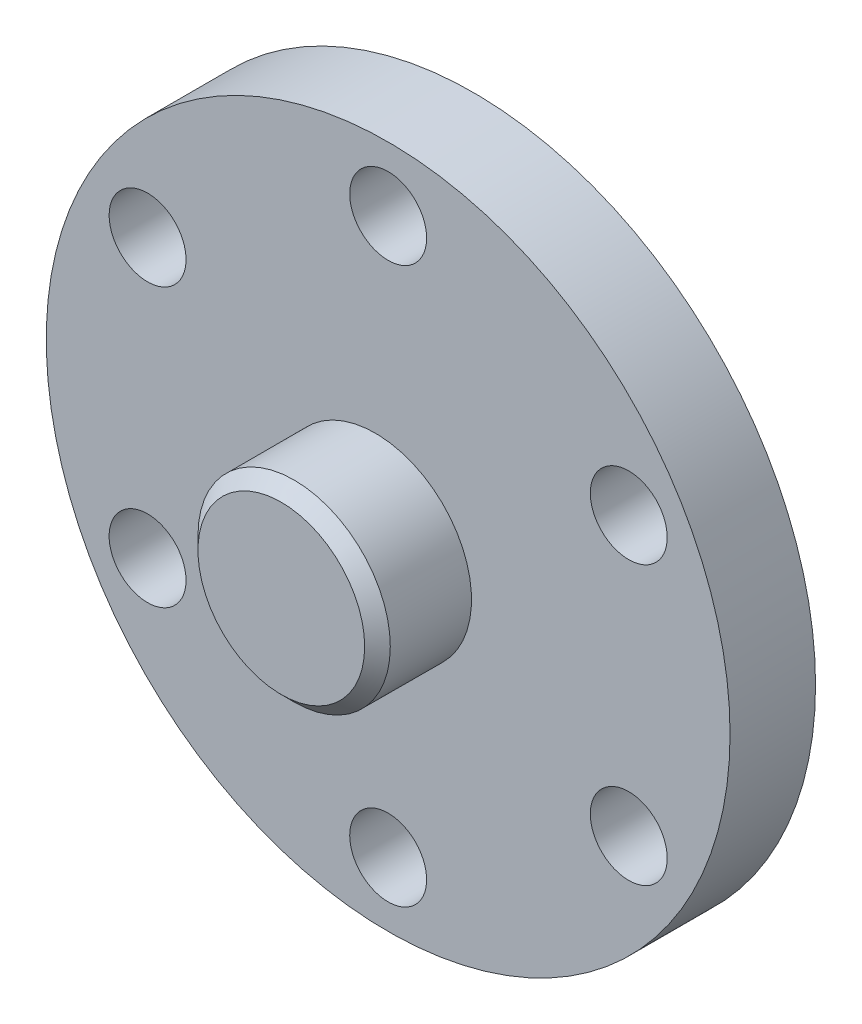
ISO-10303-21;
HEADER;
FILE_DESCRIPTION(('STEP AP214'),'2;1');
FILE_NAME('part.step','',(''),(''),'','','');
FILE_SCHEMA(('AUTOMOTIVE_DESIGN { 1 0 10303 214 1 1 1 1 }'));
ENDSEC;
DATA;
#1=APPLICATION_CONTEXT('core data for automotive mechanical design processes');
#2=APPLICATION_PROTOCOL_DEFINITION('international standard','automotive_design',2000,#1);
#3=PRODUCT_CONTEXT('',#1,'mechanical');
#4=PRODUCT('Part','Part','',(#3));
#5=PRODUCT_RELATED_PRODUCT_CATEGORY('part','',(#4));
#6=PRODUCT_DEFINITION_FORMATION('','',#4);
#7=PRODUCT_DEFINITION_CONTEXT('part definition',#1,'design');
#8=PRODUCT_DEFINITION('design','',#6,#7);
#9=PRODUCT_DEFINITION_SHAPE('','',#8);
#10=(LENGTH_UNIT() NAMED_UNIT(*) SI_UNIT(.MILLI.,.METRE.));
#11=(NAMED_UNIT(*) PLANE_ANGLE_UNIT() SI_UNIT($,.RADIAN.));
#12=(NAMED_UNIT(*) SI_UNIT($,.STERADIAN.) SOLID_ANGLE_UNIT());
#13=UNCERTAINTY_MEASURE_WITH_UNIT(LENGTH_MEASURE(1.E-05),#10,'distance_accuracy_value','');
#14=(GEOMETRIC_REPRESENTATION_CONTEXT(3) GLOBAL_UNCERTAINTY_ASSIGNED_CONTEXT((#13)) GLOBAL_UNIT_ASSIGNED_CONTEXT((#10,
#11,#12)) REPRESENTATION_CONTEXT('',''));
#15=CARTESIAN_POINT('',(0.,0.,0.));
#16=DIRECTION('',(0.,0.,1.));
#17=DIRECTION('',(1.,0.,0.));
#18=AXIS2_PLACEMENT_3D('',#15,#16,#17);
#19=CARTESIAN_POINT('',(0.,0.,20.));
#20=DIRECTION('',(0.,0.,-1.));
#21=DIRECTION('',(-1.,0.,0.));
#22=AXIS2_PLACEMENT_3D('',#19,#20,#21);
#23=CYLINDRICAL_SURFACE('',#22,80.);
#24=CARTESIAN_POINT('',(0.,0.,20.));
#25=DIRECTION('',(0.,0.,1.));
#26=DIRECTION('',(1.,0.,0.));
#27=AXIS2_PLACEMENT_3D('',#24,#25,#26);
#28=CIRCLE('',#27,80.);
#29=CARTESIAN_POINT('',(80.,0.,20.));
#30=VERTEX_POINT('',#29);
#31=EDGE_CURVE('E40',#30,#30,#28,.T.);
#32=ORIENTED_EDGE('',*,*,#31,.F.);
#33=EDGE_LOOP('',(#32));
#34=FACE_BOUND('',#33,.T.);
#35=CARTESIAN_POINT('',(0.,0.,0.));
#36=DIRECTION('',(0.,0.,1.));
#37=DIRECTION('',(1.,0.,0.));
#38=AXIS2_PLACEMENT_3D('',#35,#36,#37);
#39=CIRCLE('',#38,80.);
#40=CARTESIAN_POINT('',(80.,0.,0.));
#41=VERTEX_POINT('',#40);
#42=EDGE_CURVE('E45',#41,#41,#39,.T.);
#43=ORIENTED_EDGE('',*,*,#42,.T.);
#44=EDGE_LOOP('',(#43));
#45=FACE_BOUND('',#44,.T.);
#46=ADVANCED_FACE('F26',(#34,#45),#23,.T.);
#47=CARTESIAN_POINT('',(0.,0.,20.));
#48=DIRECTION('',(0.,0.,1.));
#49=DIRECTION('',(1.,0.,0.));
#50=AXIS2_PLACEMENT_3D('',#47,#48,#49);
#51=PLANE('',#50);
#52=CARTESIAN_POINT('',(56.2916512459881,32.5000000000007,20.));
#53=DIRECTION('',(0.,0.,1.));
#54=DIRECTION('',(0.50000000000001,-0.866025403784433,0.));
#55=AXIS2_PLACEMENT_3D('',#52,#53,#54);
#56=CIRCLE('',#55,9.);
#57=CARTESIAN_POINT('',(60.7916512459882,24.7057713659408,20.));
#58=VERTEX_POINT('',#57);
#59=EDGE_CURVE('E87',#58,#58,#56,.T.);
#60=ORIENTED_EDGE('',*,*,#59,.F.);
#61=EDGE_LOOP('',(#60));
#62=FACE_BOUND('',#61,.T.);
#63=CARTESIAN_POINT('',(56.2916512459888,-32.4999999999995,20.));
#64=DIRECTION('',(0.,0.,1.));
#65=DIRECTION('',(-0.499999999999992,-0.866025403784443,0.));
#66=AXIS2_PLACEMENT_3D('',#63,#64,#65);
#67=CIRCLE('',#66,9.);
#68=CARTESIAN_POINT('',(51.7916512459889,-40.2942286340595,20.));
#69=VERTEX_POINT('',#68);
#70=EDGE_CURVE('E81',#69,#69,#67,.T.);
#71=ORIENTED_EDGE('',*,*,#70,.F.);
#72=EDGE_LOOP('',(#71));
#73=FACE_BOUND('',#72,.T.);
#74=CARTESIAN_POINT('',(4.5389283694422E-13,-65.,20.));
#75=DIRECTION('',(0.,0.,1.));
#76=DIRECTION('',(-1.,0.,0.));
#77=AXIS2_PLACEMENT_3D('',#74,#75,#76);
#78=CIRCLE('',#77,9.);
#79=CARTESIAN_POINT('',(-8.99999999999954,-65.0000000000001,20.));
#80=VERTEX_POINT('',#79);
#81=EDGE_CURVE('E75',#80,#80,#78,.T.);
#82=ORIENTED_EDGE('',*,*,#81,.F.);
#83=EDGE_LOOP('',(#82));
#84=FACE_BOUND('',#83,.T.);
#85=CARTESIAN_POINT('',(-56.2916512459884,-32.5000000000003,20.));
#86=DIRECTION('',(0.,0.,1.));
#87=DIRECTION('',(-0.500000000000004,0.866025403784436,0.));
#88=AXIS2_PLACEMENT_3D('',#85,#86,#87);
#89=CIRCLE('',#88,9.);
#90=CARTESIAN_POINT('',(-60.7916512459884,-24.7057713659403,20.));
#91=VERTEX_POINT('',#90);
#92=EDGE_CURVE('E69',#91,#91,#89,.T.);
#93=ORIENTED_EDGE('',*,*,#92,.F.);
#94=EDGE_LOOP('',(#93));
#95=FACE_BOUND('',#94,.T.);
#96=CARTESIAN_POINT('',(-56.2916512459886,32.4999999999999,20.));
#97=DIRECTION('',(0.,0.,1.));
#98=DIRECTION('',(0.499999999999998,0.86602540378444,0.));
#99=AXIS2_PLACEMENT_3D('',#96,#97,#98);
#100=CIRCLE('',#99,9.);
#101=CARTESIAN_POINT('',(-51.7916512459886,40.2942286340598,20.));
#102=VERTEX_POINT('',#101);
#103=EDGE_CURVE('E63',#102,#102,#100,.T.);
#104=ORIENTED_EDGE('',*,*,#103,.F.);
#105=EDGE_LOOP('',(#104));
#106=FACE_BOUND('',#105,.T.);
#107=CARTESIAN_POINT('',(0.,65.,20.));
#108=DIRECTION('',(0.,0.,1.));
#109=DIRECTION('',(1.,0.,0.));
#110=AXIS2_PLACEMENT_3D('',#107,#108,#109);
#111=CIRCLE('',#110,9.);
#112=CARTESIAN_POINT('',(9.,65.,20.));
#113=VERTEX_POINT('',#112);
#114=EDGE_CURVE('E57',#113,#113,#111,.T.);
#115=ORIENTED_EDGE('',*,*,#114,.F.);
#116=EDGE_LOOP('',(#115));
#117=FACE_BOUND('',#116,.T.);
#118=CARTESIAN_POINT('',(0.,0.,20.));
#119=DIRECTION('',(0.,0.,1.));
#120=DIRECTION('',(1.,0.,0.));
#121=AXIS2_PLACEMENT_3D('',#118,#119,#120);
#122=CIRCLE('',#121,10.);
#123=CARTESIAN_POINT('',(10.,0.,20.));
#124=VERTEX_POINT('',#123);
#125=EDGE_CURVE('E36',#124,#124,#122,.T.);
#126=ORIENTED_EDGE('',*,*,#125,.F.);
#127=EDGE_LOOP('',(#126));
#128=FACE_BOUND('',#127,.T.);
#129=ORIENTED_EDGE('',*,*,#31,.T.);
#130=EDGE_LOOP('',(#129));
#131=FACE_BOUND('',#130,.T.);
#132=ADVANCED_FACE('F93',(#62,#73,#84,#95,#106,#117,#128,#131),#51,.T.);
#133=CARTESIAN_POINT('',(0.,0.,0.));
#134=DIRECTION('',(0.,0.,1.));
#135=DIRECTION('',(1.,0.,0.));
#136=AXIS2_PLACEMENT_3D('',#133,#134,#135);
#137=PLANE('',#136);
#138=CARTESIAN_POINT('',(56.2916512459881,32.5000000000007,0.));
#139=DIRECTION('',(0.,0.,1.));
#140=DIRECTION('',(0.50000000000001,-0.866025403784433,0.));
#141=AXIS2_PLACEMENT_3D('',#138,#139,#140);
#142=CIRCLE('',#141,9.);
#143=CARTESIAN_POINT('',(60.7916512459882,24.7057713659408,0.));
#144=VERTEX_POINT('',#143);
#145=EDGE_CURVE('E84',#144,#144,#142,.T.);
#146=ORIENTED_EDGE('',*,*,#145,.T.);
#147=EDGE_LOOP('',(#146));
#148=FACE_BOUND('',#147,.T.);
#149=CARTESIAN_POINT('',(56.2916512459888,-32.4999999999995,0.));
#150=DIRECTION('',(0.,0.,1.));
#151=DIRECTION('',(-0.499999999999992,-0.866025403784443,0.));
#152=AXIS2_PLACEMENT_3D('',#149,#150,#151);
#153=CIRCLE('',#152,9.);
#154=CARTESIAN_POINT('',(51.7916512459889,-40.2942286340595,0.));
#155=VERTEX_POINT('',#154);
#156=EDGE_CURVE('E78',#155,#155,#153,.T.);
#157=ORIENTED_EDGE('',*,*,#156,.T.);
#158=EDGE_LOOP('',(#157));
#159=FACE_BOUND('',#158,.T.);
#160=CARTESIAN_POINT('',(4.5389283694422E-13,-65.,0.));
#161=DIRECTION('',(0.,0.,1.));
#162=DIRECTION('',(-1.,0.,0.));
#163=AXIS2_PLACEMENT_3D('',#160,#161,#162);
#164=CIRCLE('',#163,9.);
#165=CARTESIAN_POINT('',(-8.99999999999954,-65.0000000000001,0.));
#166=VERTEX_POINT('',#165);
#167=EDGE_CURVE('E72',#166,#166,#164,.T.);
#168=ORIENTED_EDGE('',*,*,#167,.T.);
#169=EDGE_LOOP('',(#168));
#170=FACE_BOUND('',#169,.T.);
#171=CARTESIAN_POINT('',(-56.2916512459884,-32.5000000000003,0.));
#172=DIRECTION('',(0.,0.,1.));
#173=DIRECTION('',(-0.500000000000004,0.866025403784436,0.));
#174=AXIS2_PLACEMENT_3D('',#171,#172,#173);
#175=CIRCLE('',#174,9.);
#176=CARTESIAN_POINT('',(-60.7916512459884,-24.7057713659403,0.));
#177=VERTEX_POINT('',#176);
#178=EDGE_CURVE('E66',#177,#177,#175,.T.);
#179=ORIENTED_EDGE('',*,*,#178,.T.);
#180=EDGE_LOOP('',(#179));
#181=FACE_BOUND('',#180,.T.);
#182=CARTESIAN_POINT('',(-56.2916512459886,32.4999999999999,0.));
#183=DIRECTION('',(0.,0.,1.));
#184=DIRECTION('',(0.499999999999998,0.86602540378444,0.));
#185=AXIS2_PLACEMENT_3D('',#182,#183,#184);
#186=CIRCLE('',#185,9.);
#187=CARTESIAN_POINT('',(-51.7916512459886,40.2942286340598,0.));
#188=VERTEX_POINT('',#187);
#189=EDGE_CURVE('E60',#188,#188,#186,.T.);
#190=ORIENTED_EDGE('',*,*,#189,.T.);
#191=EDGE_LOOP('',(#190));
#192=FACE_BOUND('',#191,.T.);
#193=CARTESIAN_POINT('',(0.,65.,0.));
#194=DIRECTION('',(0.,0.,1.));
#195=DIRECTION('',(1.,0.,0.));
#196=AXIS2_PLACEMENT_3D('',#193,#194,#195);
#197=CIRCLE('',#196,9.);
#198=CARTESIAN_POINT('',(9.,65.,0.));
#199=VERTEX_POINT('',#198);
#200=EDGE_CURVE('E54',#199,#199,#197,.T.);
#201=ORIENTED_EDGE('',*,*,#200,.T.);
#202=EDGE_LOOP('',(#201));
#203=FACE_BOUND('',#202,.T.);
#204=ORIENTED_EDGE('',*,*,#42,.F.);
#205=EDGE_LOOP('',(#204));
#206=FACE_BOUND('',#205,.T.);
#207=ADVANCED_FACE('F96',(#148,#159,#170,#181,#192,#203,#206),#137,.F.);
#208=CARTESIAN_POINT('',(-22.5,0.,45.));
#209=DIRECTION('',(0.,0.,1.));
#210=DIRECTION('',(1.,0.,0.));
#211=AXIS2_PLACEMENT_3D('',#208,#209,#210);
#212=PLANE('',#211);
#213=CARTESIAN_POINT('',(0.,0.,45.));
#214=DIRECTION('',(0.,0.,1.));
#215=DIRECTION('',(1.,0.,0.));
#216=AXIS2_PLACEMENT_3D('',#213,#214,#215);
#217=CIRCLE('',#216,19.5);
#218=CARTESIAN_POINT('',(19.5,0.,45.));
#219=VERTEX_POINT('',#218);
#220=EDGE_CURVE('E10',#219,#219,#217,.T.);
#221=ORIENTED_EDGE('',*,*,#220,.T.);
#222=EDGE_LOOP('',(#221));
#223=FACE_BOUND('',#222,.T.);
#224=ADVANCED_FACE('F116',(#223),#212,.T.);
#225=CARTESIAN_POINT('',(0.,0.,0.));
#226=DIRECTION('',(0.,0.,-1.));
#227=DIRECTION('',(-1.,0.,0.));
#228=AXIS2_PLACEMENT_3D('',#225,#226,#227);
#229=CYLINDRICAL_SURFACE('',#228,22.5);
#230=CARTESIAN_POINT('',(0.,0.,42.));
#231=DIRECTION('',(0.,0.,1.));
#232=DIRECTION('',(1.,0.,0.));
#233=AXIS2_PLACEMENT_3D('',#230,#231,#232);
#234=CIRCLE('',#233,22.5);
#235=CARTESIAN_POINT('',(22.5,0.,42.));
#236=VERTEX_POINT('',#235);
#237=EDGE_CURVE('E32',#236,#236,#234,.F.);
#238=ORIENTED_EDGE('',*,*,#237,.T.);
#239=EDGE_LOOP('',(#238));
#240=FACE_BOUND('',#239,.T.);
#241=CARTESIAN_POINT('',(0.,0.,23.));
#242=DIRECTION('',(0.,0.,-1.));
#243=DIRECTION('',(-1.,0.,0.));
#244=AXIS2_PLACEMENT_3D('',#241,#242,#243);
#245=CIRCLE('',#244,22.5);
#246=CARTESIAN_POINT('',(-22.5,0.,23.));
#247=VERTEX_POINT('',#246);
#248=EDGE_CURVE('E48',#247,#247,#245,.T.);
#249=ORIENTED_EDGE('',*,*,#248,.F.);
#250=EDGE_LOOP('',(#249));
#251=FACE_BOUND('',#250,.T.);
#252=ADVANCED_FACE('F123',(#240,#251),#229,.T.);
#253=CARTESIAN_POINT('',(-10.,0.,23.));
#254=DIRECTION('',(0.,0.,-1.));
#255=DIRECTION('',(-1.,0.,0.));
#256=AXIS2_PLACEMENT_3D('',#253,#254,#255);
#257=PLANE('',#256);
#258=ORIENTED_EDGE('',*,*,#248,.T.);
#259=EDGE_LOOP('',(#258));
#260=FACE_BOUND('',#259,.T.);
#261=CARTESIAN_POINT('',(0.,0.,23.));
#262=DIRECTION('',(0.,0.,-1.));
#263=DIRECTION('',(-1.,0.,0.));
#264=AXIS2_PLACEMENT_3D('',#261,#262,#263);
#265=CIRCLE('',#264,10.);
#266=CARTESIAN_POINT('',(-10.,0.,23.));
#267=VERTEX_POINT('',#266);
#268=EDGE_CURVE('E51',#267,#267,#265,.T.);
#269=ORIENTED_EDGE('',*,*,#268,.F.);
#270=EDGE_LOOP('',(#269));
#271=FACE_BOUND('',#270,.T.);
#272=ADVANCED_FACE('F129',(#260,#271),#257,.T.);
#273=CARTESIAN_POINT('',(0.,0.,0.));
#274=DIRECTION('',(0.,0.,-1.));
#275=DIRECTION('',(-1.,0.,0.));
#276=AXIS2_PLACEMENT_3D('',#273,#274,#275);
#277=CYLINDRICAL_SURFACE('',#276,10.);
#278=ORIENTED_EDGE('',*,*,#268,.T.);
#279=EDGE_LOOP('',(#278));
#280=FACE_BOUND('',#279,.T.);
#281=ORIENTED_EDGE('',*,*,#125,.T.);
#282=EDGE_LOOP('',(#281));
#283=FACE_BOUND('',#282,.T.);
#284=ADVANCED_FACE('F132',(#280,#283),#277,.T.);
#285=CARTESIAN_POINT('',(0.,0.,42.));
#286=DIRECTION('',(0.,0.,-1.));
#287=DIRECTION('',(-1.,0.,0.));
#288=AXIS2_PLACEMENT_3D('',#285,#286,#287);
#289=CONICAL_SURFACE('',#288,22.5,0.785398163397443);
#290=ORIENTED_EDGE('',*,*,#220,.F.);
#291=EDGE_LOOP('',(#290));
#292=FACE_BOUND('',#291,.T.);
#293=ORIENTED_EDGE('',*,*,#237,.F.);
#294=EDGE_LOOP('',(#293));
#295=FACE_BOUND('',#294,.T.);
#296=ADVANCED_FACE('F136',(#292,#295),#289,.T.);
#297=CARTESIAN_POINT('',(0.,65.,0.));
#298=DIRECTION('',(0.,0.,1.));
#299=DIRECTION('',(1.,0.,0.));
#300=AXIS2_PLACEMENT_3D('',#297,#298,#299);
#301=CYLINDRICAL_SURFACE('',#300,9.);
#302=ORIENTED_EDGE('',*,*,#200,.F.);
#303=EDGE_LOOP('',(#302));
#304=FACE_BOUND('',#303,.T.);
#305=ORIENTED_EDGE('',*,*,#114,.T.);
#306=EDGE_LOOP('',(#305));
#307=FACE_BOUND('',#306,.T.);
#308=ADVANCED_FACE('F140',(#304,#307),#301,.F.);
#309=CARTESIAN_POINT('',(-56.2916512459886,32.4999999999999,0.));
#310=DIRECTION('',(0.,0.,1.));
#311=DIRECTION('',(1.,0.,0.));
#312=AXIS2_PLACEMENT_3D('',#309,#310,#311);
#313=CYLINDRICAL_SURFACE('',#312,9.);
#314=ORIENTED_EDGE('',*,*,#189,.F.);
#315=EDGE_LOOP('',(#314));
#316=FACE_BOUND('',#315,.T.);
#317=ORIENTED_EDGE('',*,*,#103,.T.);
#318=EDGE_LOOP('',(#317));
#319=FACE_BOUND('',#318,.T.);
#320=ADVANCED_FACE('F144',(#316,#319),#313,.F.);
#321=CARTESIAN_POINT('',(-56.2916512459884,-32.5000000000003,0.));
#322=DIRECTION('',(0.,0.,1.));
#323=DIRECTION('',(1.,0.,0.));
#324=AXIS2_PLACEMENT_3D('',#321,#322,#323);
#325=CYLINDRICAL_SURFACE('',#324,9.);
#326=ORIENTED_EDGE('',*,*,#178,.F.);
#327=EDGE_LOOP('',(#326));
#328=FACE_BOUND('',#327,.T.);
#329=ORIENTED_EDGE('',*,*,#92,.T.);
#330=EDGE_LOOP('',(#329));
#331=FACE_BOUND('',#330,.T.);
#332=ADVANCED_FACE('F147',(#328,#331),#325,.F.);
#333=CARTESIAN_POINT('',(4.5389283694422E-13,-65.,0.));
#334=DIRECTION('',(0.,0.,1.));
#335=DIRECTION('',(1.,0.,0.));
#336=AXIS2_PLACEMENT_3D('',#333,#334,#335);
#337=CYLINDRICAL_SURFACE('',#336,9.);
#338=ORIENTED_EDGE('',*,*,#167,.F.);
#339=EDGE_LOOP('',(#338));
#340=FACE_BOUND('',#339,.T.);
#341=ORIENTED_EDGE('',*,*,#81,.T.);
#342=EDGE_LOOP('',(#341));
#343=FACE_BOUND('',#342,.T.);
#344=ADVANCED_FACE('F151',(#340,#343),#337,.F.);
#345=CARTESIAN_POINT('',(56.2916512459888,-32.4999999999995,0.));
#346=DIRECTION('',(0.,0.,1.));
#347=DIRECTION('',(1.,0.,0.));
#348=AXIS2_PLACEMENT_3D('',#345,#346,#347);
#349=CYLINDRICAL_SURFACE('',#348,9.);
#350=ORIENTED_EDGE('',*,*,#156,.F.);
#351=EDGE_LOOP('',(#350));
#352=FACE_BOUND('',#351,.T.);
#353=ORIENTED_EDGE('',*,*,#70,.T.);
#354=EDGE_LOOP('',(#353));
#355=FACE_BOUND('',#354,.T.);
#356=ADVANCED_FACE('F155',(#352,#355),#349,.F.);
#357=CARTESIAN_POINT('',(56.2916512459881,32.5000000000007,0.));
#358=DIRECTION('',(0.,0.,1.));
#359=DIRECTION('',(1.,0.,0.));
#360=AXIS2_PLACEMENT_3D('',#357,#358,#359);
#361=CYLINDRICAL_SURFACE('',#360,9.);
#362=ORIENTED_EDGE('',*,*,#145,.F.);
#363=EDGE_LOOP('',(#362));
#364=FACE_BOUND('',#363,.T.);
#365=ORIENTED_EDGE('',*,*,#59,.T.);
#366=EDGE_LOOP('',(#365));
#367=FACE_BOUND('',#366,.T.);
#368=ADVANCED_FACE('F91',(#364,#367),#361,.F.);
#369=CLOSED_SHELL('',(#46,#132,#207,#224,#252,#272,#284,#296,#308,#320,#332,#344,#356,#368));
#370=MANIFOLD_SOLID_BREP('B2',#369);
#371=ADVANCED_BREP_SHAPE_REPRESENTATION('',(#18,#370),#14);
#372=SHAPE_DEFINITION_REPRESENTATION(#9,#371);
ENDSEC;
END-ISO-10303-21;
